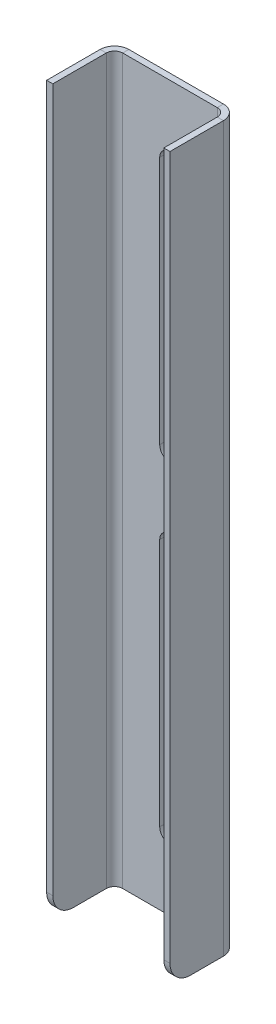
ISO-10303-21;
HEADER;
FILE_DESCRIPTION(('STEP AP214'),'2;1');
FILE_NAME('part.step','',(''),(''),'','','');
FILE_SCHEMA(('AUTOMOTIVE_DESIGN { 1 0 10303 214 1 1 1 1 }'));
ENDSEC;
DATA;
#1=APPLICATION_CONTEXT('core data for automotive mechanical design processes');
#2=APPLICATION_PROTOCOL_DEFINITION('international standard','automotive_design',2000,#1);
#3=PRODUCT_CONTEXT('',#1,'mechanical');
#4=PRODUCT('Part','Part','',(#3));
#5=PRODUCT_RELATED_PRODUCT_CATEGORY('part','',(#4));
#6=PRODUCT_DEFINITION_FORMATION('','',#4);
#7=PRODUCT_DEFINITION_CONTEXT('part definition',#1,'design');
#8=PRODUCT_DEFINITION('design','',#6,#7);
#9=PRODUCT_DEFINITION_SHAPE('','',#8);
#10=(LENGTH_UNIT() NAMED_UNIT(*) SI_UNIT(.MILLI.,.METRE.));
#11=(NAMED_UNIT(*) PLANE_ANGLE_UNIT() SI_UNIT($,.RADIAN.));
#12=(NAMED_UNIT(*) SI_UNIT($,.STERADIAN.) SOLID_ANGLE_UNIT());
#13=UNCERTAINTY_MEASURE_WITH_UNIT(LENGTH_MEASURE(1.E-05),#10,'distance_accuracy_value','');
#14=(GEOMETRIC_REPRESENTATION_CONTEXT(3) GLOBAL_UNCERTAINTY_ASSIGNED_CONTEXT((#13)) GLOBAL_UNIT_ASSIGNED_CONTEXT((#10,
#11,#12)) REPRESENTATION_CONTEXT('',''));
#15=CARTESIAN_POINT('',(0.,0.,0.));
#16=DIRECTION('',(0.,0.,1.));
#17=DIRECTION('',(1.,0.,0.));
#18=AXIS2_PLACEMENT_3D('',#15,#16,#17);
#19=CARTESIAN_POINT('',(0.,352.,0.));
#20=DIRECTION('',(0.,0.,-1.));
#21=DIRECTION('',(-1.,0.,0.));
#22=AXIS2_PLACEMENT_3D('',#19,#20,#21);
#23=PLANE('',#22);
#24=DIRECTION('',(0.,1.,0.));
#25=VECTOR('',#24,1.);
#26=CARTESIAN_POINT('',(35.,156.,0.));
#27=LINE('',#26,#25);
#28=CARTESIAN_POINT('',(35.,35.,0.));
#29=VERTEX_POINT('',#28);
#30=CARTESIAN_POINT('',(35.,156.,0.));
#31=VERTEX_POINT('',#30);
#32=EDGE_CURVE('E337',#29,#31,#27,.T.);
#33=ORIENTED_EDGE('',*,*,#32,.T.);
#34=CARTESIAN_POINT('',(30.,156.,0.));
#35=DIRECTION('',(0.,0.,1.));
#36=DIRECTION('',(1.,0.,0.));
#37=AXIS2_PLACEMENT_3D('',#34,#35,#36);
#38=CIRCLE('',#37,5.00000000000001);
#39=CARTESIAN_POINT('',(25.,156.,0.));
#40=VERTEX_POINT('',#39);
#41=EDGE_CURVE('E340',#31,#40,#38,.T.);
#42=ORIENTED_EDGE('',*,*,#41,.T.);
#43=DIRECTION('',(0.,-1.,0.));
#44=VECTOR('',#43,1.);
#45=CARTESIAN_POINT('',(25.,156.,0.));
#46=LINE('',#45,#44);
#47=CARTESIAN_POINT('',(25.,35.,0.));
#48=VERTEX_POINT('',#47);
#49=EDGE_CURVE('E344',#40,#48,#46,.T.);
#50=ORIENTED_EDGE('',*,*,#49,.T.);
#51=CARTESIAN_POINT('',(30.,35.,0.));
#52=DIRECTION('',(0.,0.,1.));
#53=DIRECTION('',(1.,0.,0.));
#54=AXIS2_PLACEMENT_3D('',#51,#52,#53);
#55=CIRCLE('',#54,4.99999999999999);
#56=EDGE_CURVE('E347',#48,#29,#55,.T.);
#57=ORIENTED_EDGE('',*,*,#56,.T.);
#58=EDGE_LOOP('',(#33,#42,#50,#57));
#59=FACE_BOUND('',#58,.T.);
#60=DIRECTION('',(0.,1.,0.));
#61=VECTOR('',#60,1.);
#62=CARTESIAN_POINT('',(35.,317.,0.));
#63=LINE('',#62,#61);
#64=CARTESIAN_POINT('',(35.,196.,0.));
#65=VERTEX_POINT('',#64);
#66=CARTESIAN_POINT('',(35.,317.,0.));
#67=VERTEX_POINT('',#66);
#68=EDGE_CURVE('E356',#65,#67,#63,.T.);
#69=ORIENTED_EDGE('',*,*,#68,.T.);
#70=CARTESIAN_POINT('',(30.,317.,0.));
#71=DIRECTION('',(0.,0.,1.));
#72=DIRECTION('',(1.,0.,0.));
#73=AXIS2_PLACEMENT_3D('',#70,#71,#72);
#74=CIRCLE('',#73,5.00000000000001);
#75=CARTESIAN_POINT('',(25.,317.,0.));
#76=VERTEX_POINT('',#75);
#77=EDGE_CURVE('E359',#67,#76,#74,.T.);
#78=ORIENTED_EDGE('',*,*,#77,.T.);
#79=DIRECTION('',(0.,-1.,0.));
#80=VECTOR('',#79,1.);
#81=CARTESIAN_POINT('',(25.,317.,0.));
#82=LINE('',#81,#80);
#83=CARTESIAN_POINT('',(25.,196.,0.));
#84=VERTEX_POINT('',#83);
#85=EDGE_CURVE('E362',#76,#84,#82,.T.);
#86=ORIENTED_EDGE('',*,*,#85,.T.);
#87=CARTESIAN_POINT('',(30.,196.,0.));
#88=DIRECTION('',(0.,0.,1.));
#89=DIRECTION('',(1.,0.,0.));
#90=AXIS2_PLACEMENT_3D('',#87,#88,#89);
#91=CIRCLE('',#90,5.);
#92=EDGE_CURVE('E365',#84,#65,#91,.T.);
#93=ORIENTED_EDGE('',*,*,#92,.T.);
#94=EDGE_LOOP('',(#69,#78,#86,#93));
#95=FACE_BOUND('',#94,.T.);
#96=DIRECTION('',(1.,0.,0.));
#97=VECTOR('',#96,1.);
#98=CARTESIAN_POINT('',(0.,0.,0.));
#99=LINE('',#98,#97);
#100=CARTESIAN_POINT('',(6.99999999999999,0.,0.));
#101=VERTEX_POINT('',#100);
#102=CARTESIAN_POINT('',(52.9999999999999,0.,0.));
#103=VERTEX_POINT('',#102);
#104=EDGE_CURVE('E353',#101,#103,#99,.T.);
#105=ORIENTED_EDGE('',*,*,#104,.F.);
#106=DIRECTION('',(0.,-1.,0.));
#107=VECTOR('',#106,1.);
#108=CARTESIAN_POINT('',(6.99999999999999,0.,0.));
#109=LINE('',#108,#107);
#110=CARTESIAN_POINT('',(6.99999999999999,352.,0.));
#111=VERTEX_POINT('',#110);
#112=EDGE_CURVE('E263',#101,#111,#109,.F.);
#113=ORIENTED_EDGE('',*,*,#112,.T.);
#114=DIRECTION('',(-1.,0.,0.));
#115=VECTOR('',#114,1.);
#116=CARTESIAN_POINT('',(0.,352.,0.));
#117=LINE('',#116,#115);
#118=CARTESIAN_POINT('',(52.9999999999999,352.,0.));
#119=VERTEX_POINT('',#118);
#120=EDGE_CURVE('E350',#119,#111,#117,.T.);
#121=ORIENTED_EDGE('',*,*,#120,.F.);
#122=DIRECTION('',(0.,1.,0.));
#123=VECTOR('',#122,1.);
#124=CARTESIAN_POINT('',(52.9999999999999,352.,0.));
#125=LINE('',#124,#123);
#126=EDGE_CURVE('E314',#119,#103,#125,.F.);
#127=ORIENTED_EDGE('',*,*,#126,.T.);
#128=EDGE_LOOP('',(#105,#113,#121,#127));
#129=FACE_BOUND('',#128,.T.);
#130=ADVANCED_FACE('F74',(#59,#95,#129),#23,.T.);
#131=CARTESIAN_POINT('',(0.,352.,3.));
#132=DIRECTION('',(0.,0.,-1.));
#133=DIRECTION('',(-1.,0.,0.));
#134=AXIS2_PLACEMENT_3D('',#131,#132,#133);
#135=PLANE('',#134);
#136=DIRECTION('',(0.,1.,0.));
#137=VECTOR('',#136,1.);
#138=CARTESIAN_POINT('',(35.,352.,3.));
#139=LINE('',#138,#137);
#140=CARTESIAN_POINT('',(35.,35.,3.));
#141=VERTEX_POINT('',#140);
#142=CARTESIAN_POINT('',(35.,156.,3.));
#143=VERTEX_POINT('',#142);
#144=EDGE_CURVE('E334',#141,#143,#139,.T.);
#145=ORIENTED_EDGE('',*,*,#144,.F.);
#146=CARTESIAN_POINT('',(30.,35.,3.));
#147=DIRECTION('',(0.,0.,1.));
#148=DIRECTION('',(1.,0.,0.));
#149=AXIS2_PLACEMENT_3D('',#146,#147,#148);
#150=CIRCLE('',#149,4.99999999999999);
#151=CARTESIAN_POINT('',(25.,35.,3.));
#152=VERTEX_POINT('',#151);
#153=EDGE_CURVE('E372',#152,#141,#150,.T.);
#154=ORIENTED_EDGE('',*,*,#153,.F.);
#155=DIRECTION('',(0.,1.,0.));
#156=VECTOR('',#155,1.);
#157=CARTESIAN_POINT('',(25.,352.,3.));
#158=LINE('',#157,#156);
#159=CARTESIAN_POINT('',(25.,156.,3.));
#160=VERTEX_POINT('',#159);
#161=EDGE_CURVE('E376',#160,#152,#158,.F.);
#162=ORIENTED_EDGE('',*,*,#161,.F.);
#163=CARTESIAN_POINT('',(30.,156.,3.));
#164=DIRECTION('',(0.,0.,1.));
#165=DIRECTION('',(1.,0.,0.));
#166=AXIS2_PLACEMENT_3D('',#163,#164,#165);
#167=CIRCLE('',#166,5.00000000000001);
#168=EDGE_CURVE('E371',#143,#160,#167,.T.);
#169=ORIENTED_EDGE('',*,*,#168,.F.);
#170=EDGE_LOOP('',(#145,#154,#162,#169));
#171=FACE_BOUND('',#170,.T.);
#172=DIRECTION('',(0.,1.,0.));
#173=VECTOR('',#172,1.);
#174=CARTESIAN_POINT('',(35.,352.,3.));
#175=LINE('',#174,#173);
#176=CARTESIAN_POINT('',(35.,196.,3.));
#177=VERTEX_POINT('',#176);
#178=CARTESIAN_POINT('',(35.,317.,3.));
#179=VERTEX_POINT('',#178);
#180=EDGE_CURVE('E384',#177,#179,#175,.T.);
#181=ORIENTED_EDGE('',*,*,#180,.F.);
#182=CARTESIAN_POINT('',(30.,196.,3.));
#183=DIRECTION('',(0.,0.,1.));
#184=DIRECTION('',(1.,0.,0.));
#185=AXIS2_PLACEMENT_3D('',#182,#183,#184);
#186=CIRCLE('',#185,5.);
#187=CARTESIAN_POINT('',(25.,196.,3.));
#188=VERTEX_POINT('',#187);
#189=EDGE_CURVE('E341',#188,#177,#186,.T.);
#190=ORIENTED_EDGE('',*,*,#189,.F.);
#191=DIRECTION('',(0.,1.,0.));
#192=VECTOR('',#191,1.);
#193=CARTESIAN_POINT('',(25.,352.,3.));
#194=LINE('',#193,#192);
#195=CARTESIAN_POINT('',(25.,317.,3.));
#196=VERTEX_POINT('',#195);
#197=EDGE_CURVE('E392',#196,#188,#194,.F.);
#198=ORIENTED_EDGE('',*,*,#197,.F.);
#199=CARTESIAN_POINT('',(30.,317.,3.));
#200=DIRECTION('',(0.,0.,1.));
#201=DIRECTION('',(1.,0.,0.));
#202=AXIS2_PLACEMENT_3D('',#199,#200,#201);
#203=CIRCLE('',#202,5.00000000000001);
#204=EDGE_CURVE('E389',#179,#196,#203,.T.);
#205=ORIENTED_EDGE('',*,*,#204,.F.);
#206=EDGE_LOOP('',(#181,#190,#198,#205));
#207=FACE_BOUND('',#206,.T.);
#208=DIRECTION('',(0.,-1.,0.));
#209=VECTOR('',#208,1.);
#210=CARTESIAN_POINT('',(6.99999999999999,0.,3.));
#211=LINE('',#210,#209);
#212=CARTESIAN_POINT('',(6.99999999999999,0.,3.));
#213=VERTEX_POINT('',#212);
#214=CARTESIAN_POINT('',(6.99999999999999,352.,3.));
#215=VERTEX_POINT('',#214);
#216=EDGE_CURVE('E276',#213,#215,#211,.F.);
#217=ORIENTED_EDGE('',*,*,#216,.F.);
#218=DIRECTION('',(-1.,0.,0.));
#219=VECTOR('',#218,1.);
#220=CARTESIAN_POINT('',(0.,0.,3.));
#221=LINE('',#220,#219);
#222=CARTESIAN_POINT('',(52.9999999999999,0.,2.99999999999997));
#223=VERTEX_POINT('',#222);
#224=EDGE_CURVE('E381',#213,#223,#221,.F.);
#225=ORIENTED_EDGE('',*,*,#224,.T.);
#226=DIRECTION('',(0.,1.,0.));
#227=VECTOR('',#226,1.);
#228=CARTESIAN_POINT('',(52.9999999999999,352.,2.99999999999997));
#229=LINE('',#228,#227);
#230=CARTESIAN_POINT('',(52.9999999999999,352.,2.99999999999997));
#231=VERTEX_POINT('',#230);
#232=EDGE_CURVE('E327',#231,#223,#229,.F.);
#233=ORIENTED_EDGE('',*,*,#232,.F.);
#234=DIRECTION('',(-1.,0.,0.));
#235=VECTOR('',#234,1.);
#236=CARTESIAN_POINT('',(0.,352.,3.));
#237=LINE('',#236,#235);
#238=EDGE_CURVE('E375',#231,#215,#237,.T.);
#239=ORIENTED_EDGE('',*,*,#238,.T.);
#240=EDGE_LOOP('',(#217,#225,#233,#239));
#241=FACE_BOUND('',#240,.T.);
#242=ADVANCED_FACE('F442',(#171,#207,#241),#135,.F.);
#243=CARTESIAN_POINT('',(0.,0.,0.));
#244=DIRECTION('',(0.,1.,0.));
#245=DIRECTION('',(1.,0.,0.));
#246=AXIS2_PLACEMENT_3D('',#243,#244,#245);
#247=PLANE('',#246);
#248=ORIENTED_EDGE('',*,*,#224,.F.);
#249=DIRECTION('',(0.,0.,-1.));
#250=VECTOR('',#249,1.);
#251=CARTESIAN_POINT('',(6.99999999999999,0.,3.));
#252=LINE('',#251,#250);
#253=EDGE_CURVE('E270',#213,#101,#252,.T.);
#254=ORIENTED_EDGE('',*,*,#253,.T.);
#255=ORIENTED_EDGE('',*,*,#104,.T.);
#256=DIRECTION('',(0.,0.,-1.));
#257=VECTOR('',#256,1.);
#258=CARTESIAN_POINT('',(52.9999999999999,0.,2.99999999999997));
#259=LINE('',#258,#257);
#260=EDGE_CURVE('E331',#223,#103,#259,.T.);
#261=ORIENTED_EDGE('',*,*,#260,.F.);
#262=EDGE_LOOP('',(#248,#254,#255,#261));
#263=FACE_BOUND('',#262,.T.);
#264=ADVANCED_FACE('F448',(#263),#247,.F.);
#265=CARTESIAN_POINT('',(0.,352.,0.));
#266=DIRECTION('',(0.,-1.,0.));
#267=DIRECTION('',(-1.,0.,0.));
#268=AXIS2_PLACEMENT_3D('',#265,#266,#267);
#269=PLANE('',#268);
#270=DIRECTION('',(0.,0.,-1.));
#271=VECTOR('',#270,1.);
#272=CARTESIAN_POINT('',(6.99999999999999,352.,3.));
#273=LINE('',#272,#271);
#274=EDGE_CURVE('E280',#215,#111,#273,.T.);
#275=ORIENTED_EDGE('',*,*,#274,.F.);
#276=ORIENTED_EDGE('',*,*,#238,.F.);
#277=DIRECTION('',(0.,0.,-1.));
#278=VECTOR('',#277,1.);
#279=CARTESIAN_POINT('',(52.9999999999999,352.,2.99999999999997));
#280=LINE('',#279,#278);
#281=EDGE_CURVE('E321',#231,#119,#280,.T.);
#282=ORIENTED_EDGE('',*,*,#281,.T.);
#283=ORIENTED_EDGE('',*,*,#120,.T.);
#284=EDGE_LOOP('',(#275,#276,#282,#283));
#285=FACE_BOUND('',#284,.T.);
#286=ADVANCED_FACE('F477',(#285),#269,.F.);
#287=CARTESIAN_POINT('',(25.,317.,0.));
#288=DIRECTION('',(1.,0.,0.));
#289=DIRECTION('',(0.,-1.,0.));
#290=AXIS2_PLACEMENT_3D('',#287,#288,#289);
#291=PLANE('',#290);
#292=DIRECTION('',(0.,0.,-1.));
#293=VECTOR('',#292,1.);
#294=CARTESIAN_POINT('',(25.,317.,0.));
#295=LINE('',#294,#293);
#296=EDGE_CURVE('E409',#196,#76,#295,.T.);
#297=ORIENTED_EDGE('',*,*,#296,.F.);
#298=ORIENTED_EDGE('',*,*,#197,.T.);
#299=DIRECTION('',(0.,0.,-1.));
#300=VECTOR('',#299,1.);
#301=CARTESIAN_POINT('',(25.,196.,0.));
#302=LINE('',#301,#300);
#303=EDGE_CURVE('E407',#188,#84,#302,.T.);
#304=ORIENTED_EDGE('',*,*,#303,.T.);
#305=ORIENTED_EDGE('',*,*,#85,.F.);
#306=EDGE_LOOP('',(#297,#298,#304,#305));
#307=FACE_BOUND('',#306,.T.);
#308=ADVANCED_FACE('F481',(#307),#291,.T.);
#309=CARTESIAN_POINT('',(30.,196.,0.));
#310=DIRECTION('',(0.,0.,1.));
#311=DIRECTION('',(1.,0.,0.));
#312=AXIS2_PLACEMENT_3D('',#309,#310,#311);
#313=CYLINDRICAL_SURFACE('',#312,5.);
#314=ORIENTED_EDGE('',*,*,#303,.F.);
#315=ORIENTED_EDGE('',*,*,#189,.T.);
#316=DIRECTION('',(0.,0.,-1.));
#317=VECTOR('',#316,1.);
#318=CARTESIAN_POINT('',(35.,196.,0.));
#319=LINE('',#318,#317);
#320=EDGE_CURVE('E405',#177,#65,#319,.T.);
#321=ORIENTED_EDGE('',*,*,#320,.T.);
#322=ORIENTED_EDGE('',*,*,#92,.F.);
#323=EDGE_LOOP('',(#314,#315,#321,#322));
#324=FACE_BOUND('',#323,.T.);
#325=ADVANCED_FACE('F485',(#324),#313,.F.);
#326=CARTESIAN_POINT('',(35.,317.,0.));
#327=DIRECTION('',(-1.,0.,0.));
#328=DIRECTION('',(0.,1.,0.));
#329=AXIS2_PLACEMENT_3D('',#326,#327,#328);
#330=PLANE('',#329);
#331=ORIENTED_EDGE('',*,*,#320,.F.);
#332=ORIENTED_EDGE('',*,*,#180,.T.);
#333=DIRECTION('',(0.,0.,-1.));
#334=VECTOR('',#333,1.);
#335=CARTESIAN_POINT('',(35.,317.,0.));
#336=LINE('',#335,#334);
#337=EDGE_CURVE('E403',#179,#67,#336,.T.);
#338=ORIENTED_EDGE('',*,*,#337,.T.);
#339=ORIENTED_EDGE('',*,*,#68,.F.);
#340=EDGE_LOOP('',(#331,#332,#338,#339));
#341=FACE_BOUND('',#340,.T.);
#342=ADVANCED_FACE('F469',(#341),#330,.T.);
#343=CARTESIAN_POINT('',(25.,156.,0.));
#344=DIRECTION('',(1.,0.,0.));
#345=DIRECTION('',(0.,-1.,0.));
#346=AXIS2_PLACEMENT_3D('',#343,#344,#345);
#347=PLANE('',#346);
#348=DIRECTION('',(0.,0.,-1.));
#349=VECTOR('',#348,1.);
#350=CARTESIAN_POINT('',(25.,156.,0.));
#351=LINE('',#350,#349);
#352=EDGE_CURVE('E401',#160,#40,#351,.T.);
#353=ORIENTED_EDGE('',*,*,#352,.F.);
#354=ORIENTED_EDGE('',*,*,#161,.T.);
#355=DIRECTION('',(0.,0.,-1.));
#356=VECTOR('',#355,1.);
#357=CARTESIAN_POINT('',(25.,35.,0.));
#358=LINE('',#357,#356);
#359=EDGE_CURVE('E399',#152,#48,#358,.T.);
#360=ORIENTED_EDGE('',*,*,#359,.T.);
#361=ORIENTED_EDGE('',*,*,#49,.F.);
#362=EDGE_LOOP('',(#353,#354,#360,#361));
#363=FACE_BOUND('',#362,.T.);
#364=ADVANCED_FACE('F465',(#363),#347,.T.);
#365=CARTESIAN_POINT('',(30.,35.,0.));
#366=DIRECTION('',(0.,0.,1.));
#367=DIRECTION('',(1.,0.,0.));
#368=AXIS2_PLACEMENT_3D('',#365,#366,#367);
#369=CYLINDRICAL_SURFACE('',#368,4.99999999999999);
#370=ORIENTED_EDGE('',*,*,#359,.F.);
#371=ORIENTED_EDGE('',*,*,#153,.T.);
#372=DIRECTION('',(0.,0.,-1.));
#373=VECTOR('',#372,1.);
#374=CARTESIAN_POINT('',(35.,35.,0.));
#375=LINE('',#374,#373);
#376=EDGE_CURVE('E397',#141,#29,#375,.T.);
#377=ORIENTED_EDGE('',*,*,#376,.T.);
#378=ORIENTED_EDGE('',*,*,#56,.F.);
#379=EDGE_LOOP('',(#370,#371,#377,#378));
#380=FACE_BOUND('',#379,.T.);
#381=ADVANCED_FACE('F460',(#380),#369,.F.);
#382=CARTESIAN_POINT('',(35.,156.,0.));
#383=DIRECTION('',(-1.,0.,0.));
#384=DIRECTION('',(0.,1.,0.));
#385=AXIS2_PLACEMENT_3D('',#382,#383,#384);
#386=PLANE('',#385);
#387=ORIENTED_EDGE('',*,*,#376,.F.);
#388=ORIENTED_EDGE('',*,*,#144,.T.);
#389=DIRECTION('',(0.,0.,-1.));
#390=VECTOR('',#389,1.);
#391=CARTESIAN_POINT('',(35.,156.,0.));
#392=LINE('',#391,#390);
#393=EDGE_CURVE('E368',#143,#31,#392,.T.);
#394=ORIENTED_EDGE('',*,*,#393,.T.);
#395=ORIENTED_EDGE('',*,*,#32,.F.);
#396=EDGE_LOOP('',(#387,#388,#394,#395));
#397=FACE_BOUND('',#396,.T.);
#398=ADVANCED_FACE('F456',(#397),#386,.T.);
#399=CARTESIAN_POINT('',(30.,156.,0.));
#400=DIRECTION('',(0.,0.,1.));
#401=DIRECTION('',(1.,0.,0.));
#402=AXIS2_PLACEMENT_3D('',#399,#400,#401);
#403=CYLINDRICAL_SURFACE('',#402,5.00000000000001);
#404=ORIENTED_EDGE('',*,*,#168,.T.);
#405=ORIENTED_EDGE('',*,*,#352,.T.);
#406=ORIENTED_EDGE('',*,*,#41,.F.);
#407=ORIENTED_EDGE('',*,*,#393,.F.);
#408=EDGE_LOOP('',(#404,#405,#406,#407));
#409=FACE_BOUND('',#408,.T.);
#410=ADVANCED_FACE('F459',(#409),#403,.F.);
#411=CARTESIAN_POINT('',(30.,317.,0.));
#412=DIRECTION('',(0.,0.,1.));
#413=DIRECTION('',(1.,0.,0.));
#414=AXIS2_PLACEMENT_3D('',#411,#412,#413);
#415=CYLINDRICAL_SURFACE('',#414,5.00000000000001);
#416=ORIENTED_EDGE('',*,*,#204,.T.);
#417=ORIENTED_EDGE('',*,*,#296,.T.);
#418=ORIENTED_EDGE('',*,*,#77,.F.);
#419=ORIENTED_EDGE('',*,*,#337,.F.);
#420=EDGE_LOOP('',(#416,#417,#418,#419));
#421=FACE_BOUND('',#420,.T.);
#422=ADVANCED_FACE('F462',(#421),#415,.F.);
#423=CARTESIAN_POINT('',(53.,0.,7.00000000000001));
#424=DIRECTION('',(0.,-1.,0.));
#425=DIRECTION('',(0.,0.,-1.));
#426=AXIS2_PLACEMENT_3D('',#423,#424,#425);
#427=PLANE('',#426);
#428=DIRECTION('',(-1.,0.,0.));
#429=VECTOR('',#428,1.);
#430=CARTESIAN_POINT('',(60.,0.,6.99999999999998));
#431=LINE('',#430,#429);
#432=CARTESIAN_POINT('',(57.,0.,7.));
#433=VERTEX_POINT('',#432);
#434=CARTESIAN_POINT('',(60.,0.,6.99999999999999));
#435=VERTEX_POINT('',#434);
#436=EDGE_CURVE('E283',#433,#435,#431,.F.);
#437=ORIENTED_EDGE('',*,*,#436,.F.);
#438=CARTESIAN_POINT('',(53.,0.,7.00000000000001));
#439=DIRECTION('',(0.,1.,0.));
#440=DIRECTION('',(0.,0.,1.));
#441=AXIS2_PLACEMENT_3D('',#438,#439,#440);
#442=CIRCLE('',#441,4.00000000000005);
#443=EDGE_CURVE('E324',#223,#433,#442,.F.);
#444=ORIENTED_EDGE('',*,*,#443,.F.);
#445=ORIENTED_EDGE('',*,*,#260,.T.);
#446=CARTESIAN_POINT('',(53.,0.,7.00000000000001));
#447=DIRECTION('',(0.,1.,0.));
#448=DIRECTION('',(0.,0.,1.));
#449=AXIS2_PLACEMENT_3D('',#446,#447,#448);
#450=CIRCLE('',#449,7.00000000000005);
#451=EDGE_CURVE('E317',#103,#435,#450,.F.);
#452=ORIENTED_EDGE('',*,*,#451,.T.);
#453=EDGE_LOOP('',(#437,#444,#445,#452));
#454=FACE_BOUND('',#453,.T.);
#455=ADVANCED_FACE('F474',(#454),#427,.T.);
#456=CARTESIAN_POINT('',(53.,352.,7.00000000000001));
#457=DIRECTION('',(0.,-1.,0.));
#458=DIRECTION('',(0.,0.,-1.));
#459=AXIS2_PLACEMENT_3D('',#456,#457,#458);
#460=PLANE('',#459);
#461=CARTESIAN_POINT('',(53.,352.,7.00000000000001));
#462=DIRECTION('',(0.,1.,0.));
#463=DIRECTION('',(0.,0.,1.));
#464=AXIS2_PLACEMENT_3D('',#461,#462,#463);
#465=CIRCLE('',#464,4.00000000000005);
#466=CARTESIAN_POINT('',(57.,352.,7.));
#467=VERTEX_POINT('',#466);
#468=EDGE_CURVE('E289',#467,#231,#465,.T.);
#469=ORIENTED_EDGE('',*,*,#468,.F.);
#470=DIRECTION('',(-1.,0.,0.));
#471=VECTOR('',#470,1.);
#472=CARTESIAN_POINT('',(56.9999999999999,352.,7.00000000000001));
#473=LINE('',#472,#471);
#474=CARTESIAN_POINT('',(59.9999999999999,352.,7.));
#475=VERTEX_POINT('',#474);
#476=EDGE_CURVE('E307',#467,#475,#473,.F.);
#477=ORIENTED_EDGE('',*,*,#476,.T.);
#478=CARTESIAN_POINT('',(53.,352.,7.00000000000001));
#479=DIRECTION('',(0.,1.,0.));
#480=DIRECTION('',(0.,0.,1.));
#481=AXIS2_PLACEMENT_3D('',#478,#479,#480);
#482=CIRCLE('',#481,7.00000000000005);
#483=EDGE_CURVE('E318',#475,#119,#482,.T.);
#484=ORIENTED_EDGE('',*,*,#483,.T.);
#485=ORIENTED_EDGE('',*,*,#281,.F.);
#486=EDGE_LOOP('',(#469,#477,#484,#485));
#487=FACE_BOUND('',#486,.T.);
#488=ADVANCED_FACE('F453',(#487),#460,.F.);
#489=CARTESIAN_POINT('',(53.,352.,7.00000000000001));
#490=DIRECTION('',(0.,1.,0.));
#491=DIRECTION('',(1.,0.,0.));
#492=AXIS2_PLACEMENT_3D('',#489,#490,#491);
#493=CYLINDRICAL_SURFACE('',#492,7.00000000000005);
#494=ORIENTED_EDGE('',*,*,#126,.F.);
#495=ORIENTED_EDGE('',*,*,#483,.F.);
#496=DIRECTION('',(0.,1.,0.));
#497=VECTOR('',#496,1.);
#498=CARTESIAN_POINT('',(60.,0.,6.99999999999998));
#499=LINE('',#498,#497);
#500=EDGE_CURVE('E304',#475,#435,#499,.F.);
#501=ORIENTED_EDGE('',*,*,#500,.T.);
#502=ORIENTED_EDGE('',*,*,#451,.F.);
#503=EDGE_LOOP('',(#494,#495,#501,#502));
#504=FACE_BOUND('',#503,.T.);
#505=ADVANCED_FACE('F499',(#504),#493,.T.);
#506=CARTESIAN_POINT('',(53.,352.,7.00000000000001));
#507=DIRECTION('',(0.,1.,0.));
#508=DIRECTION('',(1.,0.,0.));
#509=AXIS2_PLACEMENT_3D('',#506,#507,#508);
#510=CYLINDRICAL_SURFACE('',#509,4.00000000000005);
#511=ORIENTED_EDGE('',*,*,#232,.T.);
#512=ORIENTED_EDGE('',*,*,#443,.T.);
#513=DIRECTION('',(0.,1.,0.));
#514=VECTOR('',#513,1.);
#515=CARTESIAN_POINT('',(57.,0.,6.99999999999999));
#516=LINE('',#515,#514);
#517=EDGE_CURVE('E310',#433,#467,#516,.T.);
#518=ORIENTED_EDGE('',*,*,#517,.T.);
#519=ORIENTED_EDGE('',*,*,#468,.T.);
#520=EDGE_LOOP('',(#511,#512,#518,#519));
#521=FACE_BOUND('',#520,.T.);
#522=ADVANCED_FACE('F524',(#521),#510,.F.);
#523=CARTESIAN_POINT('',(60.,0.,2.99999999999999));
#524=DIRECTION('',(0.,1.,0.));
#525=DIRECTION('',(-1.,0.,0.));
#526=AXIS2_PLACEMENT_3D('',#523,#524,#525);
#527=PLANE('',#526);
#528=DIRECTION('',(0.,0.,-1.));
#529=VECTOR('',#528,1.);
#530=CARTESIAN_POINT('',(60.0000000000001,0.,33.));
#531=LINE('',#530,#529);
#532=CARTESIAN_POINT('',(60.0000000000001,0.,23.));
#533=VERTEX_POINT('',#532);
#534=EDGE_CURVE('E295',#533,#435,#531,.T.);
#535=ORIENTED_EDGE('',*,*,#534,.F.);
#536=DIRECTION('',(-1.,0.,0.));
#537=VECTOR('',#536,1.);
#538=CARTESIAN_POINT('',(60.0000000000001,0.,23.));
#539=LINE('',#538,#537);
#540=CARTESIAN_POINT('',(57.0000000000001,0.,23.));
#541=VERTEX_POINT('',#540);
#542=EDGE_CURVE('E411',#533,#541,#539,.T.);
#543=ORIENTED_EDGE('',*,*,#542,.T.);
#544=DIRECTION('',(0.,0.,1.));
#545=VECTOR('',#544,1.);
#546=CARTESIAN_POINT('',(57.,0.,3.));
#547=LINE('',#546,#545);
#548=EDGE_CURVE('E302',#541,#433,#547,.F.);
#549=ORIENTED_EDGE('',*,*,#548,.T.);
#550=ORIENTED_EDGE('',*,*,#436,.T.);
#551=EDGE_LOOP('',(#535,#543,#549,#550));
#552=FACE_BOUND('',#551,.T.);
#553=ADVANCED_FACE('F547',(#552),#527,.F.);
#554=CARTESIAN_POINT('',(60.,352.,33.));
#555=DIRECTION('',(0.,-1.,0.));
#556=DIRECTION('',(1.,0.,0.));
#557=AXIS2_PLACEMENT_3D('',#554,#555,#556);
#558=PLANE('',#557);
#559=ORIENTED_EDGE('',*,*,#476,.F.);
#560=DIRECTION('',(0.,0.,-1.));
#561=VECTOR('',#560,1.);
#562=CARTESIAN_POINT('',(57.,352.,33.));
#563=LINE('',#562,#561);
#564=CARTESIAN_POINT('',(57.,352.,33.));
#565=VERTEX_POINT('',#564);
#566=EDGE_CURVE('E300',#467,#565,#563,.F.);
#567=ORIENTED_EDGE('',*,*,#566,.T.);
#568=DIRECTION('',(-1.,0.,0.));
#569=VECTOR('',#568,1.);
#570=CARTESIAN_POINT('',(60.,352.,33.));
#571=LINE('',#570,#569);
#572=CARTESIAN_POINT('',(60.,352.,33.));
#573=VERTEX_POINT('',#572);
#574=EDGE_CURVE('E286',#573,#565,#571,.T.);
#575=ORIENTED_EDGE('',*,*,#574,.F.);
#576=DIRECTION('',(0.,0.,1.));
#577=VECTOR('',#576,1.);
#578=CARTESIAN_POINT('',(60.,352.,33.));
#579=LINE('',#578,#577);
#580=EDGE_CURVE('E293',#475,#573,#579,.T.);
#581=ORIENTED_EDGE('',*,*,#580,.F.);
#582=EDGE_LOOP('',(#559,#567,#575,#581));
#583=FACE_BOUND('',#582,.T.);
#584=ADVANCED_FACE('F534',(#583),#558,.F.);
#585=CARTESIAN_POINT('',(60.0000000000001,0.,33.));
#586=DIRECTION('',(-1.,0.,0.));
#587=DIRECTION('',(0.,0.,1.));
#588=AXIS2_PLACEMENT_3D('',#585,#586,#587);
#589=PLANE('',#588);
#590=DIRECTION('',(0.,-1.,0.));
#591=VECTOR('',#590,1.);
#592=CARTESIAN_POINT('',(60.0000000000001,0.,33.));
#593=LINE('',#592,#591);
#594=CARTESIAN_POINT('',(60.0000000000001,10.,33.));
#595=VERTEX_POINT('',#594);
#596=EDGE_CURVE('E290',#573,#595,#593,.T.);
#597=ORIENTED_EDGE('',*,*,#596,.T.);
#598=CARTESIAN_POINT('',(60.0000000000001,10.,23.));
#599=DIRECTION('',(-1.,0.,0.));
#600=DIRECTION('',(0.,0.,1.));
#601=AXIS2_PLACEMENT_3D('',#598,#599,#600);
#602=CIRCLE('',#601,10.);
#603=EDGE_CURVE('E419',#595,#533,#602,.F.);
#604=ORIENTED_EDGE('',*,*,#603,.T.);
#605=ORIENTED_EDGE('',*,*,#534,.T.);
#606=ORIENTED_EDGE('',*,*,#500,.F.);
#607=ORIENTED_EDGE('',*,*,#580,.T.);
#608=EDGE_LOOP('',(#597,#604,#605,#606,#607));
#609=FACE_BOUND('',#608,.T.);
#610=ADVANCED_FACE('F542',(#609),#589,.F.);
#611=CARTESIAN_POINT('',(57.0000000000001,0.,33.));
#612=DIRECTION('',(-1.,0.,0.));
#613=DIRECTION('',(0.,0.,1.));
#614=AXIS2_PLACEMENT_3D('',#611,#612,#613);
#615=PLANE('',#614);
#616=ORIENTED_EDGE('',*,*,#548,.F.);
#617=CARTESIAN_POINT('',(57.0000000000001,10.,23.));
#618=DIRECTION('',(-1.,0.,0.));
#619=DIRECTION('',(0.,0.,1.));
#620=AXIS2_PLACEMENT_3D('',#617,#618,#619);
#621=CIRCLE('',#620,10.);
#622=CARTESIAN_POINT('',(57.0000000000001,10.,33.));
#623=VERTEX_POINT('',#622);
#624=EDGE_CURVE('E415',#541,#623,#621,.T.);
#625=ORIENTED_EDGE('',*,*,#624,.T.);
#626=DIRECTION('',(0.,1.,0.));
#627=VECTOR('',#626,1.);
#628=CARTESIAN_POINT('',(57.0000000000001,0.,33.));
#629=LINE('',#628,#627);
#630=EDGE_CURVE('E297',#565,#623,#629,.F.);
#631=ORIENTED_EDGE('',*,*,#630,.F.);
#632=ORIENTED_EDGE('',*,*,#566,.F.);
#633=ORIENTED_EDGE('',*,*,#517,.F.);
#634=EDGE_LOOP('',(#616,#625,#631,#632,#633));
#635=FACE_BOUND('',#634,.T.);
#636=ADVANCED_FACE('F530',(#635),#615,.T.);
#637=CARTESIAN_POINT('',(60.0000000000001,0.,33.));
#638=DIRECTION('',(0.,0.,-1.));
#639=DIRECTION('',(-1.,0.,0.));
#640=AXIS2_PLACEMENT_3D('',#637,#638,#639);
#641=PLANE('',#640);
#642=ORIENTED_EDGE('',*,*,#630,.T.);
#643=DIRECTION('',(-1.,0.,0.));
#644=VECTOR('',#643,1.);
#645=CARTESIAN_POINT('',(60.0000000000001,10.,33.));
#646=LINE('',#645,#644);
#647=EDGE_CURVE('E417',#623,#595,#646,.F.);
#648=ORIENTED_EDGE('',*,*,#647,.T.);
#649=ORIENTED_EDGE('',*,*,#596,.F.);
#650=ORIENTED_EDGE('',*,*,#574,.T.);
#651=EDGE_LOOP('',(#642,#648,#649,#650));
#652=FACE_BOUND('',#651,.T.);
#653=ADVANCED_FACE('F538',(#652),#641,.F.);
#654=CARTESIAN_POINT('',(6.99999999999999,352.,7.));
#655=DIRECTION('',(0.,1.,0.));
#656=DIRECTION('',(0.,0.,1.));
#657=AXIS2_PLACEMENT_3D('',#654,#655,#656);
#658=PLANE('',#657);
#659=DIRECTION('',(1.,0.,0.));
#660=VECTOR('',#659,1.);
#661=CARTESIAN_POINT('',(0.,352.,6.99999999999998));
#662=LINE('',#661,#660);
#663=CARTESIAN_POINT('',(2.99999999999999,352.,6.99999999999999));
#664=VERTEX_POINT('',#663);
#665=CARTESIAN_POINT('',(0.,352.,6.99999999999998));
#666=VERTEX_POINT('',#665);
#667=EDGE_CURVE('E246',#664,#666,#662,.F.);
#668=ORIENTED_EDGE('',*,*,#667,.F.);
#669=CARTESIAN_POINT('',(6.99999999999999,352.,7.));
#670=DIRECTION('',(0.,-1.,0.));
#671=DIRECTION('',(0.,0.,-1.));
#672=AXIS2_PLACEMENT_3D('',#669,#670,#671);
#673=CIRCLE('',#672,4.);
#674=EDGE_CURVE('E273',#215,#664,#673,.F.);
#675=ORIENTED_EDGE('',*,*,#674,.F.);
#676=ORIENTED_EDGE('',*,*,#274,.T.);
#677=CARTESIAN_POINT('',(6.99999999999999,352.,7.));
#678=DIRECTION('',(0.,-1.,0.));
#679=DIRECTION('',(0.,0.,-1.));
#680=AXIS2_PLACEMENT_3D('',#677,#678,#679);
#681=CIRCLE('',#680,7.);
#682=EDGE_CURVE('E266',#111,#666,#681,.F.);
#683=ORIENTED_EDGE('',*,*,#682,.T.);
#684=EDGE_LOOP('',(#668,#675,#676,#683));
#685=FACE_BOUND('',#684,.T.);
#686=ADVANCED_FACE('F519',(#685),#658,.T.);
#687=CARTESIAN_POINT('',(6.99999999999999,0.,7.));
#688=DIRECTION('',(0.,1.,0.));
#689=DIRECTION('',(0.,0.,1.));
#690=AXIS2_PLACEMENT_3D('',#687,#688,#689);
#691=PLANE('',#690);
#692=CARTESIAN_POINT('',(6.99999999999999,0.,7.));
#693=DIRECTION('',(0.,-1.,0.));
#694=DIRECTION('',(0.,0.,-1.));
#695=AXIS2_PLACEMENT_3D('',#692,#693,#694);
#696=CIRCLE('',#695,4.);
#697=CARTESIAN_POINT('',(2.99999999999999,0.,6.99999999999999));
#698=VERTEX_POINT('',#697);
#699=EDGE_CURVE('E242',#698,#213,#696,.T.);
#700=ORIENTED_EDGE('',*,*,#699,.F.);
#701=DIRECTION('',(1.,0.,0.));
#702=VECTOR('',#701,1.);
#703=CARTESIAN_POINT('',(2.99999999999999,0.,6.99999999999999));
#704=LINE('',#703,#702);
#705=CARTESIAN_POINT('',(0.,0.,6.99999999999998));
#706=VERTEX_POINT('',#705);
#707=EDGE_CURVE('E257',#698,#706,#704,.F.);
#708=ORIENTED_EDGE('',*,*,#707,.T.);
#709=CARTESIAN_POINT('',(6.99999999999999,0.,7.));
#710=DIRECTION('',(0.,-1.,0.));
#711=DIRECTION('',(0.,0.,-1.));
#712=AXIS2_PLACEMENT_3D('',#709,#710,#711);
#713=CIRCLE('',#712,7.);
#714=EDGE_CURVE('E267',#706,#101,#713,.T.);
#715=ORIENTED_EDGE('',*,*,#714,.T.);
#716=ORIENTED_EDGE('',*,*,#253,.F.);
#717=EDGE_LOOP('',(#700,#708,#715,#716));
#718=FACE_BOUND('',#717,.T.);
#719=ADVANCED_FACE('F433',(#718),#691,.F.);
#720=CARTESIAN_POINT('',(6.99999999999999,0.,7.));
#721=DIRECTION('',(0.,-1.,0.));
#722=DIRECTION('',(-1.,0.,0.));
#723=AXIS2_PLACEMENT_3D('',#720,#721,#722);
#724=CYLINDRICAL_SURFACE('',#723,7.);
#725=ORIENTED_EDGE('',*,*,#112,.F.);
#726=ORIENTED_EDGE('',*,*,#714,.F.);
#727=DIRECTION('',(0.,-1.,0.));
#728=VECTOR('',#727,1.);
#729=CARTESIAN_POINT('',(0.,352.,6.99999999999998));
#730=LINE('',#729,#728);
#731=EDGE_CURVE('E255',#706,#666,#730,.F.);
#732=ORIENTED_EDGE('',*,*,#731,.T.);
#733=ORIENTED_EDGE('',*,*,#682,.F.);
#734=EDGE_LOOP('',(#725,#726,#732,#733));
#735=FACE_BOUND('',#734,.T.);
#736=ADVANCED_FACE('F570',(#735),#724,.T.);
#737=CARTESIAN_POINT('',(6.99999999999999,0.,7.));
#738=DIRECTION('',(0.,-1.,0.));
#739=DIRECTION('',(-1.,0.,0.));
#740=AXIS2_PLACEMENT_3D('',#737,#738,#739);
#741=CYLINDRICAL_SURFACE('',#740,4.);
#742=ORIENTED_EDGE('',*,*,#216,.T.);
#743=ORIENTED_EDGE('',*,*,#674,.T.);
#744=DIRECTION('',(0.,-1.,0.));
#745=VECTOR('',#744,1.);
#746=CARTESIAN_POINT('',(2.99999999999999,352.,6.99999999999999));
#747=LINE('',#746,#745);
#748=EDGE_CURVE('E260',#664,#698,#747,.T.);
#749=ORIENTED_EDGE('',*,*,#748,.T.);
#750=ORIENTED_EDGE('',*,*,#699,.T.);
#751=EDGE_LOOP('',(#742,#743,#749,#750));
#752=FACE_BOUND('',#751,.T.);
#753=ADVANCED_FACE('F428',(#752),#741,.F.);
#754=CARTESIAN_POINT('',(0.,352.,2.99999999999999));
#755=DIRECTION('',(0.,-1.,0.));
#756=DIRECTION('',(0.,0.,-1.));
#757=AXIS2_PLACEMENT_3D('',#754,#755,#756);
#758=PLANE('',#757);
#759=ORIENTED_EDGE('',*,*,#667,.T.);
#760=DIRECTION('',(0.,0.,-1.));
#761=VECTOR('',#760,1.);
#762=CARTESIAN_POINT('',(-1.04950770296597E-13,352.,33.));
#763=LINE('',#762,#761);
#764=CARTESIAN_POINT('',(-1.04950770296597E-13,352.,33.));
#765=VERTEX_POINT('',#764);
#766=EDGE_CURVE('E228',#765,#666,#763,.T.);
#767=ORIENTED_EDGE('',*,*,#766,.F.);
#768=DIRECTION('',(1.,0.,0.));
#769=VECTOR('',#768,1.);
#770=CARTESIAN_POINT('',(-1.04744500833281E-13,352.,33.));
#771=LINE('',#770,#769);
#772=CARTESIAN_POINT('',(2.9999999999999,352.,33.));
#773=VERTEX_POINT('',#772);
#774=EDGE_CURVE('E233',#765,#773,#771,.T.);
#775=ORIENTED_EDGE('',*,*,#774,.T.);
#776=DIRECTION('',(0.,0.,1.));
#777=VECTOR('',#776,1.);
#778=CARTESIAN_POINT('',(3.,352.,3.));
#779=LINE('',#778,#777);
#780=EDGE_CURVE('E253',#773,#664,#779,.F.);
#781=ORIENTED_EDGE('',*,*,#780,.T.);
#782=EDGE_LOOP('',(#759,#767,#775,#781));
#783=FACE_BOUND('',#782,.T.);
#784=ADVANCED_FACE('F245',(#783),#758,.F.);
#785=CARTESIAN_POINT('',(-1.04950770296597E-13,0.,33.));
#786=DIRECTION('',(0.,1.,0.));
#787=DIRECTION('',(0.,0.,1.));
#788=AXIS2_PLACEMENT_3D('',#785,#786,#787);
#789=PLANE('',#788);
#790=DIRECTION('',(0.,0.,-1.));
#791=VECTOR('',#790,1.);
#792=CARTESIAN_POINT('',(2.9999999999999,0.,33.));
#793=LINE('',#792,#791);
#794=CARTESIAN_POINT('',(2.99999999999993,0.,23.));
#795=VERTEX_POINT('',#794);
#796=EDGE_CURVE('E249',#698,#795,#793,.F.);
#797=ORIENTED_EDGE('',*,*,#796,.T.);
#798=DIRECTION('',(1.,0.,0.));
#799=VECTOR('',#798,1.);
#800=CARTESIAN_POINT('',(0.,0.,23.));
#801=LINE('',#800,#799);
#802=CARTESIAN_POINT('',(0.,0.,23.));
#803=VERTEX_POINT('',#802);
#804=EDGE_CURVE('E82',#795,#803,#801,.F.);
#805=ORIENTED_EDGE('',*,*,#804,.T.);
#806=DIRECTION('',(0.,0.,1.));
#807=VECTOR('',#806,1.);
#808=CARTESIAN_POINT('',(-1.04950770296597E-13,0.,33.));
#809=LINE('',#808,#807);
#810=EDGE_CURVE('E234',#706,#803,#809,.T.);
#811=ORIENTED_EDGE('',*,*,#810,.F.);
#812=ORIENTED_EDGE('',*,*,#707,.F.);
#813=EDGE_LOOP('',(#797,#805,#811,#812));
#814=FACE_BOUND('',#813,.T.);
#815=ADVANCED_FACE('F434',(#814),#789,.F.);
#816=CARTESIAN_POINT('',(-1.04950770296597E-13,352.,33.));
#817=DIRECTION('',(1.,0.,0.));
#818=DIRECTION('',(0.,0.,-1.));
#819=AXIS2_PLACEMENT_3D('',#816,#817,#818);
#820=PLANE('',#819);
#821=ORIENTED_EDGE('',*,*,#810,.T.);
#822=CARTESIAN_POINT('',(0.,10.,23.));
#823=DIRECTION('',(1.,0.,0.));
#824=DIRECTION('',(0.,0.,-1.));
#825=AXIS2_PLACEMENT_3D('',#822,#823,#824);
#826=CIRCLE('',#825,10.);
#827=CARTESIAN_POINT('',(-1.04950770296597E-13,10.,33.));
#828=VERTEX_POINT('',#827);
#829=EDGE_CURVE('E13',#803,#828,#826,.F.);
#830=ORIENTED_EDGE('',*,*,#829,.T.);
#831=DIRECTION('',(0.,1.,0.));
#832=VECTOR('',#831,1.);
#833=CARTESIAN_POINT('',(-1.04950770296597E-13,352.,33.));
#834=LINE('',#833,#832);
#835=EDGE_CURVE('E223',#828,#765,#834,.T.);
#836=ORIENTED_EDGE('',*,*,#835,.T.);
#837=ORIENTED_EDGE('',*,*,#766,.T.);
#838=ORIENTED_EDGE('',*,*,#731,.F.);
#839=EDGE_LOOP('',(#821,#830,#836,#837,#838));
#840=FACE_BOUND('',#839,.T.);
#841=ADVANCED_FACE('F225',(#840),#820,.F.);
#842=CARTESIAN_POINT('',(2.9999999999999,352.,33.));
#843=DIRECTION('',(1.,0.,0.));
#844=DIRECTION('',(0.,0.,-1.));
#845=AXIS2_PLACEMENT_3D('',#842,#843,#844);
#846=PLANE('',#845);
#847=DIRECTION('',(0.,-1.,0.));
#848=VECTOR('',#847,1.);
#849=CARTESIAN_POINT('',(2.9999999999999,352.,33.));
#850=LINE('',#849,#848);
#851=CARTESIAN_POINT('',(2.9999999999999,10.,33.));
#852=VERTEX_POINT('',#851);
#853=EDGE_CURVE('E238',#852,#773,#850,.F.);
#854=ORIENTED_EDGE('',*,*,#853,.F.);
#855=CARTESIAN_POINT('',(2.99999999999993,10.,23.));
#856=DIRECTION('',(1.,0.,0.));
#857=DIRECTION('',(0.,0.,-1.));
#858=AXIS2_PLACEMENT_3D('',#855,#856,#857);
#859=CIRCLE('',#858,10.);
#860=EDGE_CURVE('E96',#852,#795,#859,.T.);
#861=ORIENTED_EDGE('',*,*,#860,.T.);
#862=ORIENTED_EDGE('',*,*,#796,.F.);
#863=ORIENTED_EDGE('',*,*,#748,.F.);
#864=ORIENTED_EDGE('',*,*,#780,.F.);
#865=EDGE_LOOP('',(#854,#861,#862,#863,#864));
#866=FACE_BOUND('',#865,.T.);
#867=ADVANCED_FACE('F424',(#866),#846,.T.);
#868=CARTESIAN_POINT('',(-1.04950770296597E-13,352.,33.));
#869=DIRECTION('',(0.,0.,-1.));
#870=DIRECTION('',(-1.,0.,0.));
#871=AXIS2_PLACEMENT_3D('',#868,#869,#870);
#872=PLANE('',#871);
#873=ORIENTED_EDGE('',*,*,#835,.F.);
#874=DIRECTION('',(1.,0.,0.));
#875=VECTOR('',#874,1.);
#876=CARTESIAN_POINT('',(-1.04950770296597E-13,10.,33.));
#877=LINE('',#876,#875);
#878=EDGE_CURVE('E421',#828,#852,#877,.T.);
#879=ORIENTED_EDGE('',*,*,#878,.T.);
#880=ORIENTED_EDGE('',*,*,#853,.T.);
#881=ORIENTED_EDGE('',*,*,#774,.F.);
#882=EDGE_LOOP('',(#873,#879,#880,#881));
#883=FACE_BOUND('',#882,.T.);
#884=ADVANCED_FACE('F237',(#883),#872,.F.);
#885=CARTESIAN_POINT('',(60.0000000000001,10.,23.));
#886=DIRECTION('',(-1.,0.,0.));
#887=DIRECTION('',(0.,0.,1.));
#888=AXIS2_PLACEMENT_3D('',#885,#886,#887);
#889=CYLINDRICAL_SURFACE('',#888,10.);
#890=ORIENTED_EDGE('',*,*,#603,.F.);
#891=ORIENTED_EDGE('',*,*,#647,.F.);
#892=ORIENTED_EDGE('',*,*,#624,.F.);
#893=ORIENTED_EDGE('',*,*,#542,.F.);
#894=EDGE_LOOP('',(#890,#891,#892,#893));
#895=FACE_BOUND('',#894,.T.);
#896=ADVANCED_FACE('F436',(#895),#889,.T.);
#897=CARTESIAN_POINT('',(0.,10.,23.));
#898=DIRECTION('',(1.,0.,0.));
#899=DIRECTION('',(0.,0.,-1.));
#900=AXIS2_PLACEMENT_3D('',#897,#898,#899);
#901=CYLINDRICAL_SURFACE('',#900,10.);
#902=ORIENTED_EDGE('',*,*,#829,.F.);
#903=ORIENTED_EDGE('',*,*,#804,.F.);
#904=ORIENTED_EDGE('',*,*,#860,.F.);
#905=ORIENTED_EDGE('',*,*,#878,.F.);
#906=EDGE_LOOP('',(#902,#903,#904,#905));
#907=FACE_BOUND('',#906,.T.);
#908=ADVANCED_FACE('F76',(#907),#901,.T.);
#909=CLOSED_SHELL('',(#130,#242,#264,#286,#308,#325,#342,#364,#381,#398,#410,#422,#455,#488,
#505,#522,#553,#584,#610,#636,#653,#686,#719,#736,#753,#784,#815,#841,#867,#884,#896,#908));
#910=MANIFOLD_SOLID_BREP('B2',#909);
#911=ADVANCED_BREP_SHAPE_REPRESENTATION('',(#18,#910),#14);
#912=SHAPE_DEFINITION_REPRESENTATION(#9,#911);
ENDSEC;
END-ISO-10303-21;
